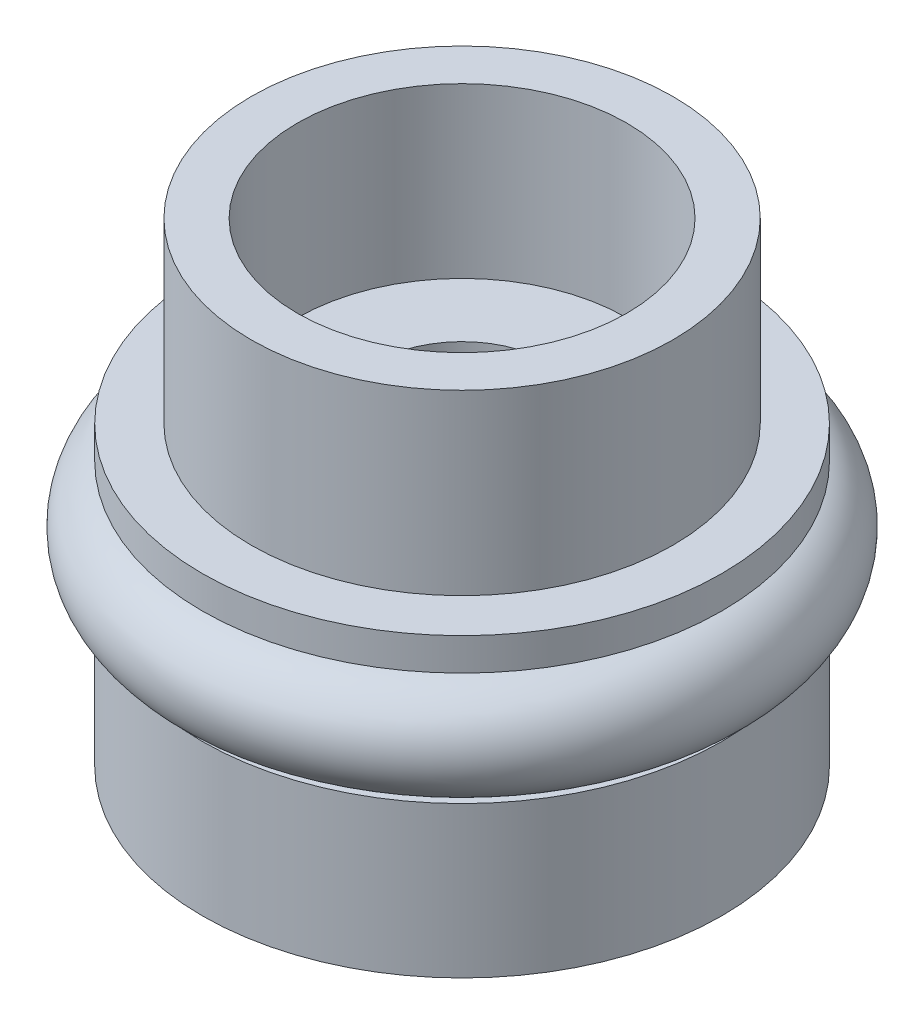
ISO-10303-21;
HEADER;
FILE_DESCRIPTION(('STEP AP214'),'2;1');
FILE_NAME('part.step','',(''),(''),'','','');
FILE_SCHEMA(('AUTOMOTIVE_DESIGN { 1 0 10303 214 1 1 1 1 }'));
ENDSEC;
DATA;
#1=APPLICATION_CONTEXT('core data for automotive mechanical design processes');
#2=APPLICATION_PROTOCOL_DEFINITION('international standard','automotive_design',2000,#1);
#3=PRODUCT_CONTEXT('',#1,'mechanical');
#4=PRODUCT('Part','Part','',(#3));
#5=PRODUCT_RELATED_PRODUCT_CATEGORY('part','',(#4));
#6=PRODUCT_DEFINITION_FORMATION('','',#4);
#7=PRODUCT_DEFINITION_CONTEXT('part definition',#1,'design');
#8=PRODUCT_DEFINITION('design','',#6,#7);
#9=PRODUCT_DEFINITION_SHAPE('','',#8);
#10=(LENGTH_UNIT() NAMED_UNIT(*) SI_UNIT(.MILLI.,.METRE.));
#11=(NAMED_UNIT(*) PLANE_ANGLE_UNIT() SI_UNIT($,.RADIAN.));
#12=(NAMED_UNIT(*) SI_UNIT($,.STERADIAN.) SOLID_ANGLE_UNIT());
#13=UNCERTAINTY_MEASURE_WITH_UNIT(LENGTH_MEASURE(1.E-05),#10,'distance_accuracy_value','');
#14=(GEOMETRIC_REPRESENTATION_CONTEXT(3) GLOBAL_UNCERTAINTY_ASSIGNED_CONTEXT((#13)) GLOBAL_UNIT_ASSIGNED_CONTEXT((#10,
#11,#12)) REPRESENTATION_CONTEXT('',''));
#15=CARTESIAN_POINT('',(0.,0.,0.));
#16=DIRECTION('',(0.,0.,1.));
#17=DIRECTION('',(1.,0.,0.));
#18=AXIS2_PLACEMENT_3D('',#15,#16,#17);
#19=CARTESIAN_POINT('',(0.,5.,0.));
#20=DIRECTION('',(0.,-1.,0.));
#21=DIRECTION('',(0.,0.,-1.));
#22=AXIS2_PLACEMENT_3D('',#19,#20,#21);
#23=CYLINDRICAL_SURFACE('',#22,4.3815);
#24=CARTESIAN_POINT('',(0.,2.5475,0.));
#25=DIRECTION('',(0.,-1.,0.));
#26=DIRECTION('',(0.,0.,-1.));
#27=AXIS2_PLACEMENT_3D('',#24,#25,#26);
#28=CIRCLE('',#27,4.3815);
#29=CARTESIAN_POINT('',(0.,2.5475,-4.3815));
#30=VERTEX_POINT('',#29);
#31=EDGE_CURVE('P0_E104',#30,#30,#28,.T.);
#32=ORIENTED_EDGE('',*,*,#31,.T.);
#33=EDGE_LOOP('',(#32));
#34=FACE_BOUND('',#33,.T.);
#35=CARTESIAN_POINT('',(0.,0.,0.));
#36=DIRECTION('',(0.,-1.,0.));
#37=DIRECTION('',(0.,0.,-1.));
#38=AXIS2_PLACEMENT_3D('',#35,#36,#37);
#39=CIRCLE('',#38,4.3815);
#40=CARTESIAN_POINT('',(0.,0.,-4.3815));
#41=VERTEX_POINT('',#40);
#42=EDGE_CURVE('P0_E30',#41,#41,#39,.T.);
#43=ORIENTED_EDGE('',*,*,#42,.F.);
#44=EDGE_LOOP('',(#43));
#45=FACE_BOUND('',#44,.T.);
#46=ADVANCED_FACE('P0_F15',(#34,#45),#23,.T.);
#47=CARTESIAN_POINT('',(0.,8.,0.));
#48=DIRECTION('',(0.,-1.,0.));
#49=DIRECTION('',(0.,0.,-1.));
#50=AXIS2_PLACEMENT_3D('',#47,#48,#49);
#51=CYLINDRICAL_SURFACE('',#50,3.556);
#52=CARTESIAN_POINT('',(0.,8.,0.));
#53=DIRECTION('',(0.,1.,0.));
#54=DIRECTION('',(0.,0.,1.));
#55=AXIS2_PLACEMENT_3D('',#52,#53,#54);
#56=CIRCLE('',#55,3.556);
#57=CARTESIAN_POINT('',(0.,8.,3.556));
#58=VERTEX_POINT('',#57);
#59=EDGE_CURVE('P0_E19',#58,#58,#56,.T.);
#60=ORIENTED_EDGE('',*,*,#59,.F.);
#61=EDGE_LOOP('',(#60));
#62=FACE_BOUND('',#61,.T.);
#63=CARTESIAN_POINT('',(0.,5.,0.));
#64=DIRECTION('',(0.,-1.,0.));
#65=DIRECTION('',(0.,0.,-1.));
#66=AXIS2_PLACEMENT_3D('',#63,#64,#65);
#67=CIRCLE('',#66,3.556);
#68=CARTESIAN_POINT('',(0.,5.,-3.556));
#69=VERTEX_POINT('',#68);
#70=EDGE_CURVE('P0_E10',#69,#69,#67,.T.);
#71=ORIENTED_EDGE('',*,*,#70,.F.);
#72=EDGE_LOOP('',(#71));
#73=FACE_BOUND('',#72,.T.);
#74=ADVANCED_FACE('P0_F17',(#62,#73),#51,.T.);
#75=CARTESIAN_POINT('',(0.,8.,0.));
#76=DIRECTION('',(0.,1.,0.));
#77=DIRECTION('',(0.,0.,1.));
#78=AXIS2_PLACEMENT_3D('',#75,#76,#77);
#79=PLANE('',#78);
#80=CARTESIAN_POINT('',(0.,8.,0.));
#81=DIRECTION('',(0.,1.,0.));
#82=DIRECTION('',(0.,0.,1.));
#83=AXIS2_PLACEMENT_3D('',#80,#81,#82);
#84=CIRCLE('',#83,2.77876);
#85=CARTESIAN_POINT('',(0.,8.,2.77876));
#86=VERTEX_POINT('',#85);
#87=EDGE_CURVE('P0_E32',#86,#86,#84,.T.);
#88=ORIENTED_EDGE('',*,*,#87,.F.);
#89=EDGE_LOOP('',(#88));
#90=FACE_BOUND('',#89,.T.);
#91=ORIENTED_EDGE('',*,*,#59,.T.);
#92=EDGE_LOOP('',(#91));
#93=FACE_BOUND('',#92,.T.);
#94=ADVANCED_FACE('P0_F66',(#90,#93),#79,.T.);
#95=CARTESIAN_POINT('',(0.,0.,0.));
#96=DIRECTION('',(0.,1.,0.));
#97=DIRECTION('',(0.,0.,1.));
#98=AXIS2_PLACEMENT_3D('',#95,#96,#97);
#99=PLANE('',#98);
#100=CARTESIAN_POINT('',(0.,0.,0.));
#101=DIRECTION('',(0.,1.,0.));
#102=DIRECTION('',(0.,0.,1.));
#103=AXIS2_PLACEMENT_3D('',#100,#101,#102);
#104=CIRCLE('',#103,1.4732);
#105=CARTESIAN_POINT('',(0.,0.,1.4732));
#106=VERTEX_POINT('',#105);
#107=EDGE_CURVE('P0_E27',#106,#106,#104,.T.);
#108=ORIENTED_EDGE('',*,*,#107,.T.);
#109=EDGE_LOOP('',(#108));
#110=FACE_BOUND('',#109,.T.);
#111=ORIENTED_EDGE('',*,*,#42,.T.);
#112=EDGE_LOOP('',(#111));
#113=FACE_BOUND('',#112,.T.);
#114=ADVANCED_FACE('P0_F44',(#110,#113),#99,.F.);
#115=CARTESIAN_POINT('',(0.,8.,0.));
#116=DIRECTION('',(0.,1.,0.));
#117=DIRECTION('',(0.,0.,1.));
#118=AXIS2_PLACEMENT_3D('',#115,#116,#117);
#119=CYLINDRICAL_SURFACE('',#118,1.4732);
#120=ORIENTED_EDGE('',*,*,#107,.F.);
#121=EDGE_LOOP('',(#120));
#122=FACE_BOUND('',#121,.T.);
#123=CARTESIAN_POINT('',(0.,5.1552,0.));
#124=DIRECTION('',(0.,1.,0.));
#125=DIRECTION('',(0.,0.,1.));
#126=AXIS2_PLACEMENT_3D('',#123,#124,#125);
#127=CIRCLE('',#126,1.4732);
#128=CARTESIAN_POINT('',(0.,5.1552,1.4732));
#129=VERTEX_POINT('',#128);
#130=EDGE_CURVE('P0_E39',#129,#129,#127,.T.);
#131=ORIENTED_EDGE('',*,*,#130,.T.);
#132=EDGE_LOOP('',(#131));
#133=FACE_BOUND('',#132,.T.);
#134=ADVANCED_FACE('P0_F47',(#122,#133),#119,.F.);
#135=CARTESIAN_POINT('',(1.4732,5.1552,0.));
#136=DIRECTION('',(0.,-1.,0.));
#137=DIRECTION('',(0.,0.,-1.));
#138=AXIS2_PLACEMENT_3D('',#135,#136,#137);
#139=PLANE('',#138);
#140=ORIENTED_EDGE('',*,*,#130,.F.);
#141=EDGE_LOOP('',(#140));
#142=FACE_BOUND('',#141,.T.);
#143=CARTESIAN_POINT('',(0.,5.1552,0.));
#144=DIRECTION('',(0.,1.,0.));
#145=DIRECTION('',(0.,0.,1.));
#146=AXIS2_PLACEMENT_3D('',#143,#144,#145);
#147=CIRCLE('',#146,2.77876);
#148=CARTESIAN_POINT('',(0.,5.1552,2.77876));
#149=VERTEX_POINT('',#148);
#150=EDGE_CURVE('P0_E35',#149,#149,#147,.T.);
#151=ORIENTED_EDGE('',*,*,#150,.T.);
#152=EDGE_LOOP('',(#151));
#153=FACE_BOUND('',#152,.T.);
#154=ADVANCED_FACE('P0_F50',(#142,#153),#139,.F.);
#155=CARTESIAN_POINT('',(0.,8.,0.));
#156=DIRECTION('',(0.,1.,0.));
#157=DIRECTION('',(0.,0.,1.));
#158=AXIS2_PLACEMENT_3D('',#155,#156,#157);
#159=CYLINDRICAL_SURFACE('',#158,2.77876);
#160=ORIENTED_EDGE('',*,*,#150,.F.);
#161=EDGE_LOOP('',(#160));
#162=FACE_BOUND('',#161,.T.);
#163=ORIENTED_EDGE('',*,*,#87,.T.);
#164=EDGE_LOOP('',(#163));
#165=FACE_BOUND('',#164,.T.);
#166=ADVANCED_FACE('P0_F56',(#162,#165),#159,.F.);
#167=CARTESIAN_POINT('',(0.,5.,0.));
#168=DIRECTION('',(0.,-1.,0.));
#169=DIRECTION('',(0.,0.,-1.));
#170=AXIS2_PLACEMENT_3D('',#167,#168,#169);
#171=PLANE('',#170);
#172=CARTESIAN_POINT('',(0.,5.,0.));
#173=DIRECTION('',(0.,-1.,0.));
#174=DIRECTION('',(0.,0.,-1.));
#175=AXIS2_PLACEMENT_3D('',#172,#173,#174);
#176=CIRCLE('',#175,4.3815);
#177=CARTESIAN_POINT('',(0.,5.,-4.3815));
#178=VERTEX_POINT('',#177);
#179=EDGE_CURVE('P0_E36',#178,#178,#176,.T.);
#180=ORIENTED_EDGE('',*,*,#179,.F.);
#181=EDGE_LOOP('',(#180));
#182=FACE_BOUND('',#181,.T.);
#183=ORIENTED_EDGE('',*,*,#70,.T.);
#184=EDGE_LOOP('',(#183));
#185=FACE_BOUND('',#184,.T.);
#186=ADVANCED_FACE('P0_F62',(#182,#185),#171,.F.);
#187=CARTESIAN_POINT('',(0.,4.4525,0.));
#188=DIRECTION('',(0.,-1.,0.));
#189=DIRECTION('',(0.,0.,-1.));
#190=AXIS2_PLACEMENT_3D('',#187,#188,#189);
#191=CIRCLE('',#190,4.3815);
#192=CARTESIAN_POINT('',(0.,4.4525,-4.3815));
#193=VERTEX_POINT('',#192);
#194=EDGE_CURVE('P0_E100',#193,#193,#191,.T.);
#195=ORIENTED_EDGE('',*,*,#194,.F.);
#196=EDGE_LOOP('',(#195));
#197=FACE_BOUND('',#196,.T.);
#198=ORIENTED_EDGE('',*,*,#179,.T.);
#199=EDGE_LOOP('',(#198));
#200=FACE_BOUND('',#199,.T.);
#201=ADVANCED_FACE('P0_F80',(#197,#200),#23,.T.);
#202=CARTESIAN_POINT('',(4.3815,2.5475,0.));
#203=DIRECTION('',(0.,-1.,0.));
#204=DIRECTION('',(0.,0.,-1.));
#205=AXIS2_PLACEMENT_3D('',#202,#203,#204);
#206=PLANE('',#205);
#207=ORIENTED_EDGE('',*,*,#31,.F.);
#208=EDGE_LOOP('',(#207));
#209=FACE_BOUND('',#208,.T.);
#210=CARTESIAN_POINT('',(0.,2.5475,0.));
#211=DIRECTION('',(0.,-1.,0.));
#212=DIRECTION('',(0.,0.,-1.));
#213=AXIS2_PLACEMENT_3D('',#210,#211,#212);
#214=CIRCLE('',#213,3.175);
#215=CARTESIAN_POINT('',(0.,2.5475,-3.175));
#216=VERTEX_POINT('',#215);
#217=EDGE_CURVE('P0_E107',#216,#216,#214,.T.);
#218=ORIENTED_EDGE('',*,*,#217,.T.);
#219=EDGE_LOOP('',(#218));
#220=FACE_BOUND('',#219,.T.);
#221=ADVANCED_FACE('P0_F87',(#209,#220),#206,.F.);
#222=CARTESIAN_POINT('',(0.,0.,0.));
#223=DIRECTION('',(0.,-1.,0.));
#224=DIRECTION('',(0.,0.,-1.));
#225=AXIS2_PLACEMENT_3D('',#222,#223,#224);
#226=CYLINDRICAL_SURFACE('',#225,3.175);
#227=ORIENTED_EDGE('',*,*,#217,.F.);
#228=EDGE_LOOP('',(#227));
#229=FACE_BOUND('',#228,.T.);
#230=CARTESIAN_POINT('',(0.,4.4525,0.));
#231=DIRECTION('',(0.,-1.,0.));
#232=DIRECTION('',(0.,0.,-1.));
#233=AXIS2_PLACEMENT_3D('',#230,#231,#232);
#234=CIRCLE('',#233,3.175);
#235=CARTESIAN_POINT('',(0.,4.4525,-3.175));
#236=VERTEX_POINT('',#235);
#237=EDGE_CURVE('P0_E110',#236,#236,#234,.T.);
#238=ORIENTED_EDGE('',*,*,#237,.T.);
#239=EDGE_LOOP('',(#238));
#240=FACE_BOUND('',#239,.T.);
#241=ADVANCED_FACE('P0_F93',(#229,#240),#226,.T.);
#242=CARTESIAN_POINT('',(4.3815,4.4525,0.));
#243=DIRECTION('',(0.,1.,0.));
#244=DIRECTION('',(0.,0.,1.));
#245=AXIS2_PLACEMENT_3D('',#242,#243,#244);
#246=PLANE('',#245);
#247=ORIENTED_EDGE('',*,*,#237,.F.);
#248=EDGE_LOOP('',(#247));
#249=FACE_BOUND('',#248,.T.);
#250=ORIENTED_EDGE('',*,*,#194,.T.);
#251=EDGE_LOOP('',(#250));
#252=FACE_BOUND('',#251,.T.);
#253=ADVANCED_FACE('P0_F114',(#249,#252),#246,.F.);
#254=CLOSED_SHELL('',(#46,#74,#94,#114,#134,#154,#166,#186,#201,#221,#241,#253));
#255=MANIFOLD_SOLID_BREP('P0_B1',#254);
#256=CARTESIAN_POINT('',(0.,3.5,0.));
#257=DIRECTION('',(0.,-1.,0.));
#258=DIRECTION('',(0.,0.,-1.));
#259=AXIS2_PLACEMENT_3D('',#256,#257,#258);
#260=TOROIDAL_SURFACE('',#259,4.064,0.889);
#261=CARTESIAN_POINT('',(0.,3.5,-4.953));
#262=VERTEX_POINT('',#261);
#263=VERTEX_LOOP('',#262);
#264=FACE_BOUND('',#263,.T.);
#265=ADVANCED_FACE('P1_F12',(#264),#260,.T.);
#266=CLOSED_SHELL('',(#265));
#267=MANIFOLD_SOLID_BREP('P1_B1',#266);
#268=ADVANCED_BREP_SHAPE_REPRESENTATION('',(#18,#255,#267),#14);
#269=SHAPE_DEFINITION_REPRESENTATION(#9,#268);
ENDSEC;
END-ISO-10303-21;
